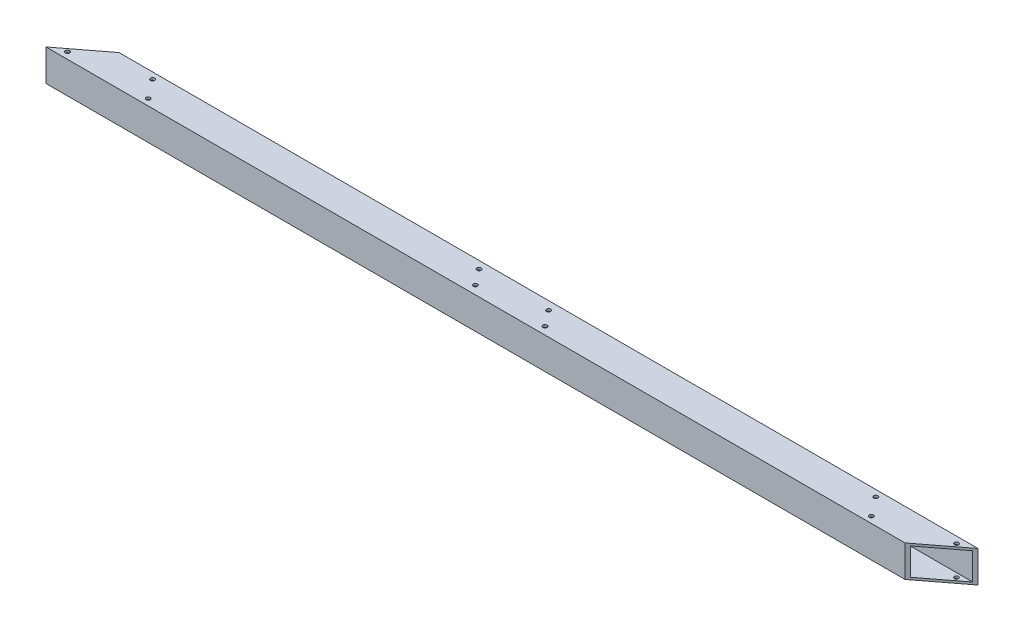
ISO-10303-21;
HEADER;
FILE_DESCRIPTION(('STEP AP214'),'2;1');
FILE_NAME('part.step','',(''),(''),'','','');
FILE_SCHEMA(('AUTOMOTIVE_DESIGN { 1 0 10303 214 1 1 1 1 }'));
ENDSEC;
DATA;
#1=APPLICATION_CONTEXT('core data for automotive mechanical design processes');
#2=APPLICATION_PROTOCOL_DEFINITION('international standard','automotive_design',2000,#1);
#3=PRODUCT_CONTEXT('',#1,'mechanical');
#4=PRODUCT('Part','Part','',(#3));
#5=PRODUCT_RELATED_PRODUCT_CATEGORY('part','',(#4));
#6=PRODUCT_DEFINITION_FORMATION('','',#4);
#7=PRODUCT_DEFINITION_CONTEXT('part definition',#1,'design');
#8=PRODUCT_DEFINITION('design','',#6,#7);
#9=PRODUCT_DEFINITION_SHAPE('','',#8);
#10=(LENGTH_UNIT() NAMED_UNIT(*) SI_UNIT(.MILLI.,.METRE.));
#11=(NAMED_UNIT(*) PLANE_ANGLE_UNIT() SI_UNIT($,.RADIAN.));
#12=(NAMED_UNIT(*) SI_UNIT($,.STERADIAN.) SOLID_ANGLE_UNIT());
#13=UNCERTAINTY_MEASURE_WITH_UNIT(LENGTH_MEASURE(1.E-05),#10,'distance_accuracy_value','');
#14=(GEOMETRIC_REPRESENTATION_CONTEXT(3) GLOBAL_UNCERTAINTY_ASSIGNED_CONTEXT((#13)) GLOBAL_UNIT_ASSIGNED_CONTEXT((#10,
#11,#12)) REPRESENTATION_CONTEXT('',''));
#15=CARTESIAN_POINT('',(0.,0.,0.));
#16=DIRECTION('',(0.,0.,1.));
#17=DIRECTION('',(1.,0.,0.));
#18=AXIS2_PLACEMENT_3D('',#15,#16,#17);
#19=CARTESIAN_POINT('',(3048.,0.,-6.66133814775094E-13));
#20=DIRECTION('',(0.,0.,-1.));
#21=DIRECTION('',(-1.,0.,0.));
#22=AXIS2_PLACEMENT_3D('',#19,#20,#21);
#23=PLANE('',#22);
#24=DIRECTION('',(-1.,0.,0.));
#25=VECTOR('',#24,1.);
#26=CARTESIAN_POINT('',(3048.,0.,-6.66133814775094E-13));
#27=LINE('',#26,#25);
#28=CARTESIAN_POINT('',(1378.39812302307,0.,0.));
#29=VERTEX_POINT('',#28);
#30=CARTESIAN_POINT('',(1.11022302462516E-13,0.,0.));
#31=VERTEX_POINT('',#30);
#32=EDGE_CURVE('E38',#29,#31,#27,.T.);
#33=ORIENTED_EDGE('',*,*,#32,.F.);
#34=DIRECTION('',(0.,1.,0.));
#35=VECTOR('',#34,1.);
#36=CARTESIAN_POINT('',(1378.39812302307,0.,2.22044604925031E-13));
#37=LINE('',#36,#35);
#38=CARTESIAN_POINT('',(1378.39812302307,50.8,0.));
#39=VERTEX_POINT('',#38);
#40=EDGE_CURVE('E251',#29,#39,#37,.T.);
#41=ORIENTED_EDGE('',*,*,#40,.T.);
#42=DIRECTION('',(-1.,0.,0.));
#43=VECTOR('',#42,1.);
#44=CARTESIAN_POINT('',(3048.,50.8,-6.66133814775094E-13));
#45=LINE('',#44,#43);
#46=CARTESIAN_POINT('',(1.11022302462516E-13,50.8,0.));
#47=VERTEX_POINT('',#46);
#48=EDGE_CURVE('E117',#39,#47,#45,.T.);
#49=ORIENTED_EDGE('',*,*,#48,.T.);
#50=DIRECTION('',(0.,-1.,0.));
#51=VECTOR('',#50,1.);
#52=CARTESIAN_POINT('',(1.11022302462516E-13,0.,0.));
#53=LINE('',#52,#51);
#54=EDGE_CURVE('E125',#47,#31,#53,.T.);
#55=ORIENTED_EDGE('',*,*,#54,.T.);
#56=EDGE_LOOP('',(#33,#41,#49,#55));
#57=FACE_BOUND('',#56,.T.);
#58=ADVANCED_FACE('F30',(#57),#23,.F.);
#59=CARTESIAN_POINT('',(3048.,0.,-6.66133814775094E-13));
#60=DIRECTION('',(0.,1.,0.));
#61=DIRECTION('',(0.,0.,1.));
#62=AXIS2_PLACEMENT_3D('',#59,#60,#61);
#63=PLANE('',#62);
#64=CARTESIAN_POINT('',(23.981912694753,0.,-10.4615786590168));
#65=DIRECTION('',(0.,-1.,0.));
#66=DIRECTION('',(0.,0.,-1.));
#67=AXIS2_PLACEMENT_3D('',#64,#65,#66);
#68=CIRCLE('',#67,3.37312000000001);
#69=CARTESIAN_POINT('',(23.981912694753,0.,-13.8346986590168));
#70=VERTEX_POINT('',#69);
#71=EDGE_CURVE('E374',#70,#70,#68,.T.);
#72=ORIENTED_EDGE('',*,*,#71,.F.);
#73=EDGE_LOOP('',(#72));
#74=FACE_BOUND('',#73,.T.);
#75=CARTESIAN_POINT('',(130.507572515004,0.,-40.5671943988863));
#76=DIRECTION('',(0.,-1.,0.));
#77=DIRECTION('',(0.,0.,-1.));
#78=AXIS2_PLACEMENT_3D('',#75,#76,#77);
#79=CIRCLE('',#78,3.37312000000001);
#80=CARTESIAN_POINT('',(130.507572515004,0.,-43.9403143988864));
#81=VERTEX_POINT('',#80);
#82=EDGE_CURVE('E179',#81,#81,#79,.T.);
#83=ORIENTED_EDGE('',*,*,#82,.F.);
#84=EDGE_LOOP('',(#83));
#85=FACE_BOUND('',#84,.T.);
#86=CARTESIAN_POINT('',(153.67607471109,0.,-10.3210292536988));
#87=DIRECTION('',(0.,-1.,0.));
#88=DIRECTION('',(0.,0.,-1.));
#89=AXIS2_PLACEMENT_3D('',#86,#87,#88);
#90=CIRCLE('',#89,3.37312000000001);
#91=CARTESIAN_POINT('',(153.67607471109,0.,-13.6941492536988));
#92=VERTEX_POINT('',#91);
#93=EDGE_CURVE('E176',#92,#92,#90,.T.);
#94=ORIENTED_EDGE('',*,*,#93,.F.);
#95=EDGE_LOOP('',(#94));
#96=FACE_BOUND('',#95,.T.);
#97=CARTESIAN_POINT('',(1420.73492080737,0.,-40.3384213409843));
#98=DIRECTION('',(0.,-1.,0.));
#99=DIRECTION('',(0.,0.,-1.));
#100=AXIS2_PLACEMENT_3D('',#97,#98,#99);
#101=CIRCLE('',#100,3.37311999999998);
#102=CARTESIAN_POINT('',(1420.73492080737,0.,-43.7115413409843));
#103=VERTEX_POINT('',#102);
#104=EDGE_CURVE('E195',#103,#103,#101,.T.);
#105=ORIENTED_EDGE('',*,*,#104,.F.);
#106=EDGE_LOOP('',(#105));
#107=FACE_BOUND('',#106,.T.);
#108=CARTESIAN_POINT('',(1291.04075879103,0.,-40.4789707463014));
#109=DIRECTION('',(0.,-1.,0.));
#110=DIRECTION('',(0.,0.,-1.));
#111=AXIS2_PLACEMENT_3D('',#108,#109,#110);
#112=CIRCLE('',#111,3.37311999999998);
#113=CARTESIAN_POINT('',(1291.04075879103,0.,-43.8520907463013));
#114=VERTEX_POINT('',#113);
#115=EDGE_CURVE('E202',#114,#114,#112,.T.);
#116=ORIENTED_EDGE('',*,*,#115,.F.);
#117=EDGE_LOOP('',(#116));
#118=FACE_BOUND('',#117,.T.);
#119=CARTESIAN_POINT('',(1314.20926098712,0.,-10.2328056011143));
#120=DIRECTION('',(0.,-1.,0.));
#121=DIRECTION('',(0.,0.,-1.));
#122=AXIS2_PLACEMENT_3D('',#119,#120,#121);
#123=CIRCLE('',#122,3.37311999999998);
#124=CARTESIAN_POINT('',(1314.20926098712,0.,-13.6059256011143));
#125=VERTEX_POINT('',#124);
#126=EDGE_CURVE('E209',#125,#125,#123,.T.);
#127=ORIENTED_EDGE('',*,*,#126,.F.);
#128=EDGE_LOOP('',(#127));
#129=FACE_BOUND('',#128,.T.);
#130=CARTESIAN_POINT('',(656.179889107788,0.,-38.6983009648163));
#131=DIRECTION('',(0.,-1.,0.));
#132=DIRECTION('',(0.,0.,-1.));
#133=AXIS2_PLACEMENT_3D('',#130,#131,#132);
#134=CIRCLE('',#133,3.39212682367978);
#135=CARTESIAN_POINT('',(656.179889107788,0.,-42.0904277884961));
#136=VERTEX_POINT('',#135);
#137=EDGE_CURVE('E216',#136,#136,#134,.T.);
#138=ORIENTED_EDGE('',*,*,#137,.F.);
#139=EDGE_LOOP('',(#138));
#140=FACE_BOUND('',#139,.T.);
#141=CARTESIAN_POINT('',(675.486974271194,0.,-13.4931633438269));
#142=DIRECTION('',(0.,-1.,0.));
#143=DIRECTION('',(0.,0.,-1.));
#144=AXIS2_PLACEMENT_3D('',#141,#142,#143);
#145=CIRCLE('',#144,3.39212682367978);
#146=CARTESIAN_POINT('',(675.486974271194,0.,-16.8852901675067));
#147=VERTEX_POINT('',#146);
#148=EDGE_CURVE('E223',#147,#147,#145,.T.);
#149=ORIENTED_EDGE('',*,*,#148,.F.);
#150=EDGE_LOOP('',(#149));
#151=FACE_BOUND('',#150,.T.);
#152=CARTESIAN_POINT('',(769.22986180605,0.,-37.306836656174));
#153=DIRECTION('',(0.,-1.,0.));
#154=DIRECTION('',(0.,0.,-1.));
#155=AXIS2_PLACEMENT_3D('',#152,#153,#154);
#156=CIRCLE('',#155,3.39212682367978);
#157=CARTESIAN_POINT('',(769.22986180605,0.,-40.6989634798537));
#158=VERTEX_POINT('',#157);
#159=EDGE_CURVE('E230',#158,#158,#156,.T.);
#160=ORIENTED_EDGE('',*,*,#159,.F.);
#161=EDGE_LOOP('',(#160));
#162=FACE_BOUND('',#161,.T.);
#163=CARTESIAN_POINT('',(788.536946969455,0.,-12.1016990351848));
#164=DIRECTION('',(0.,-1.,0.));
#165=DIRECTION('',(0.,0.,-1.));
#166=AXIS2_PLACEMENT_3D('',#163,#164,#165);
#167=CIRCLE('',#166,3.39212682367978);
#168=CARTESIAN_POINT('',(788.536946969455,0.,-15.4938258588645));
#169=VERTEX_POINT('',#168);
#170=EDGE_CURVE('E237',#169,#169,#167,.T.);
#171=ORIENTED_EDGE('',*,*,#170,.F.);
#172=EDGE_LOOP('',(#171));
#173=FACE_BOUND('',#172,.T.);
#174=DIRECTION('',(-1.,0.,0.));
#175=VECTOR('',#174,1.);
#176=CARTESIAN_POINT('',(3048.,0.,-50.8000000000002));
#177=LINE('',#176,#175);
#178=CARTESIAN_POINT('',(1444.71683350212,0.,-50.8000000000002));
#179=VERTEX_POINT('',#178);
#180=CARTESIAN_POINT('',(66.3187104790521,0.,-50.8000000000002));
#181=VERTEX_POINT('',#180);
#182=EDGE_CURVE('E122',#179,#181,#177,.T.);
#183=ORIENTED_EDGE('',*,*,#182,.F.);
#184=DIRECTION('',(0.793862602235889,0.,-0.608097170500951));
#185=VECTOR('',#184,1.);
#186=CARTESIAN_POINT('',(1444.71683350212,0.,-50.8000000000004));
#187=LINE('',#186,#185);
#188=EDGE_CURVE('E103',#29,#179,#187,.T.);
#189=ORIENTED_EDGE('',*,*,#188,.F.);
#190=ORIENTED_EDGE('',*,*,#32,.T.);
#191=DIRECTION('',(-0.793862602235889,0.,0.608097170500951));
#192=VECTOR('',#191,1.);
#193=CARTESIAN_POINT('',(1.11022302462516E-13,0.,0.));
#194=LINE('',#193,#192);
#195=EDGE_CURVE('E253',#181,#31,#194,.T.);
#196=ORIENTED_EDGE('',*,*,#195,.F.);
#197=EDGE_LOOP('',(#183,#189,#190,#196));
#198=FACE_BOUND('',#197,.T.);
#199=ADVANCED_FACE('F280',(#74,#85,#96,#107,#118,#129,#140,#151,#162,#173,#198),#63,.F.);
#200=CARTESIAN_POINT('',(3048.,0.,-50.8000000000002));
#201=DIRECTION('',(0.,0.,1.));
#202=DIRECTION('',(1.,0.,0.));
#203=AXIS2_PLACEMENT_3D('',#200,#201,#202);
#204=PLANE('',#203);
#205=ORIENTED_EDGE('',*,*,#182,.T.);
#206=DIRECTION('',(0.,1.,0.));
#207=VECTOR('',#206,1.);
#208=CARTESIAN_POINT('',(66.3187104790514,0.,-50.8000000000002));
#209=LINE('',#208,#207);
#210=CARTESIAN_POINT('',(66.3187104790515,50.8,-50.7999999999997));
#211=VERTEX_POINT('',#210);
#212=EDGE_CURVE('E109',#181,#211,#209,.T.);
#213=ORIENTED_EDGE('',*,*,#212,.T.);
#214=DIRECTION('',(-1.,0.,0.));
#215=VECTOR('',#214,1.);
#216=CARTESIAN_POINT('',(3048.,50.8,-50.8000000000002));
#217=LINE('',#216,#215);
#218=CARTESIAN_POINT('',(1444.71683350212,50.8,-50.8000000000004));
#219=VERTEX_POINT('',#218);
#220=EDGE_CURVE('E116',#219,#211,#217,.T.);
#221=ORIENTED_EDGE('',*,*,#220,.F.);
#222=DIRECTION('',(0.,-1.,0.));
#223=VECTOR('',#222,1.);
#224=CARTESIAN_POINT('',(1444.71683350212,50.8,-50.8000000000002));
#225=LINE('',#224,#223);
#226=EDGE_CURVE('E97',#219,#179,#225,.T.);
#227=ORIENTED_EDGE('',*,*,#226,.T.);
#228=EDGE_LOOP('',(#205,#213,#221,#227));
#229=FACE_BOUND('',#228,.T.);
#230=ADVANCED_FACE('F121',(#229),#204,.F.);
#231=CARTESIAN_POINT('',(3048.,50.8,-6.66133814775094E-13));
#232=DIRECTION('',(0.,-1.,0.));
#233=DIRECTION('',(0.,0.,-1.));
#234=AXIS2_PLACEMENT_3D('',#231,#232,#233);
#235=PLANE('',#234);
#236=CARTESIAN_POINT('',(23.981912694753,50.8,-10.4615786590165));
#237=DIRECTION('',(0.,-1.,0.));
#238=DIRECTION('',(0.,0.,-1.));
#239=AXIS2_PLACEMENT_3D('',#236,#237,#238);
#240=CIRCLE('',#239,3.37312000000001);
#241=CARTESIAN_POINT('',(23.981912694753,50.8,-13.8346986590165));
#242=VERTEX_POINT('',#241);
#243=EDGE_CURVE('E373',#242,#242,#240,.T.);
#244=ORIENTED_EDGE('',*,*,#243,.T.);
#245=EDGE_LOOP('',(#244));
#246=FACE_BOUND('',#245,.T.);
#247=CARTESIAN_POINT('',(130.507572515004,50.8,-40.5671943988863));
#248=DIRECTION('',(0.,-1.,0.));
#249=DIRECTION('',(0.,0.,-1.));
#250=AXIS2_PLACEMENT_3D('',#247,#248,#249);
#251=CIRCLE('',#250,3.37312000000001);
#252=CARTESIAN_POINT('',(130.507572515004,50.8,-43.9403143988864));
#253=VERTEX_POINT('',#252);
#254=EDGE_CURVE('E172',#253,#253,#251,.T.);
#255=ORIENTED_EDGE('',*,*,#254,.T.);
#256=EDGE_LOOP('',(#255));
#257=FACE_BOUND('',#256,.T.);
#258=CARTESIAN_POINT('',(153.67607471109,50.8,-10.3210292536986));
#259=DIRECTION('',(0.,-1.,0.));
#260=DIRECTION('',(0.,0.,-1.));
#261=AXIS2_PLACEMENT_3D('',#258,#259,#260);
#262=CIRCLE('',#261,3.37312000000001);
#263=CARTESIAN_POINT('',(153.67607471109,50.8,-13.6941492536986));
#264=VERTEX_POINT('',#263);
#265=EDGE_CURVE('E168',#264,#264,#262,.T.);
#266=ORIENTED_EDGE('',*,*,#265,.T.);
#267=EDGE_LOOP('',(#266));
#268=FACE_BOUND('',#267,.T.);
#269=CARTESIAN_POINT('',(1420.73492080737,50.8,-40.3384213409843));
#270=DIRECTION('',(0.,-1.,0.));
#271=DIRECTION('',(0.,0.,-1.));
#272=AXIS2_PLACEMENT_3D('',#269,#270,#271);
#273=CIRCLE('',#272,3.37311999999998);
#274=CARTESIAN_POINT('',(1420.73492080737,50.8,-43.7115413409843));
#275=VERTEX_POINT('',#274);
#276=EDGE_CURVE('E164',#275,#275,#273,.T.);
#277=ORIENTED_EDGE('',*,*,#276,.T.);
#278=EDGE_LOOP('',(#277));
#279=FACE_BOUND('',#278,.T.);
#280=CARTESIAN_POINT('',(1291.04075879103,50.8,-40.4789707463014));
#281=DIRECTION('',(0.,-1.,0.));
#282=DIRECTION('',(0.,0.,-1.));
#283=AXIS2_PLACEMENT_3D('',#280,#281,#282);
#284=CIRCLE('',#283,3.37311999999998);
#285=CARTESIAN_POINT('',(1291.04075879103,50.8,-43.8520907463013));
#286=VERTEX_POINT('',#285);
#287=EDGE_CURVE('E159',#286,#286,#284,.T.);
#288=ORIENTED_EDGE('',*,*,#287,.T.);
#289=EDGE_LOOP('',(#288));
#290=FACE_BOUND('',#289,.T.);
#291=CARTESIAN_POINT('',(1314.20926098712,50.8,-10.2328056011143));
#292=DIRECTION('',(0.,-1.,0.));
#293=DIRECTION('',(0.,0.,-1.));
#294=AXIS2_PLACEMENT_3D('',#291,#292,#293);
#295=CIRCLE('',#294,3.37311999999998);
#296=CARTESIAN_POINT('',(1314.20926098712,50.8,-13.6059256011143));
#297=VERTEX_POINT('',#296);
#298=EDGE_CURVE('E154',#297,#297,#295,.T.);
#299=ORIENTED_EDGE('',*,*,#298,.T.);
#300=EDGE_LOOP('',(#299));
#301=FACE_BOUND('',#300,.T.);
#302=CARTESIAN_POINT('',(656.179889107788,50.8,-38.6983009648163));
#303=DIRECTION('',(0.,-1.,0.));
#304=DIRECTION('',(0.,0.,-1.));
#305=AXIS2_PLACEMENT_3D('',#302,#303,#304);
#306=CIRCLE('',#305,3.39212682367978);
#307=CARTESIAN_POINT('',(656.179889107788,50.8,-42.0904277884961));
#308=VERTEX_POINT('',#307);
#309=EDGE_CURVE('E149',#308,#308,#306,.T.);
#310=ORIENTED_EDGE('',*,*,#309,.T.);
#311=EDGE_LOOP('',(#310));
#312=FACE_BOUND('',#311,.T.);
#313=CARTESIAN_POINT('',(675.486974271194,50.8,-13.4931633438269));
#314=DIRECTION('',(0.,-1.,0.));
#315=DIRECTION('',(0.,0.,-1.));
#316=AXIS2_PLACEMENT_3D('',#313,#314,#315);
#317=CIRCLE('',#316,3.39212682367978);
#318=CARTESIAN_POINT('',(675.486974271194,50.8,-16.8852901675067));
#319=VERTEX_POINT('',#318);
#320=EDGE_CURVE('E144',#319,#319,#317,.T.);
#321=ORIENTED_EDGE('',*,*,#320,.T.);
#322=EDGE_LOOP('',(#321));
#323=FACE_BOUND('',#322,.T.);
#324=CARTESIAN_POINT('',(769.22986180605,50.8,-37.306836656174));
#325=DIRECTION('',(0.,-1.,0.));
#326=DIRECTION('',(0.,0.,-1.));
#327=AXIS2_PLACEMENT_3D('',#324,#325,#326);
#328=CIRCLE('',#327,3.39212682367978);
#329=CARTESIAN_POINT('',(769.22986180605,50.8,-40.6989634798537));
#330=VERTEX_POINT('',#329);
#331=EDGE_CURVE('E139',#330,#330,#328,.T.);
#332=ORIENTED_EDGE('',*,*,#331,.T.);
#333=EDGE_LOOP('',(#332));
#334=FACE_BOUND('',#333,.T.);
#335=CARTESIAN_POINT('',(788.536946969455,50.8,-12.1016990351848));
#336=DIRECTION('',(0.,-1.,0.));
#337=DIRECTION('',(0.,0.,-1.));
#338=AXIS2_PLACEMENT_3D('',#335,#336,#337);
#339=CIRCLE('',#338,3.39212682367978);
#340=CARTESIAN_POINT('',(788.536946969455,50.8,-15.4938258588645));
#341=VERTEX_POINT('',#340);
#342=EDGE_CURVE('E134',#341,#341,#339,.T.);
#343=ORIENTED_EDGE('',*,*,#342,.T.);
#344=EDGE_LOOP('',(#343));
#345=FACE_BOUND('',#344,.T.);
#346=ORIENTED_EDGE('',*,*,#48,.F.);
#347=DIRECTION('',(0.793862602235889,0.,-0.608097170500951));
#348=VECTOR('',#347,1.);
#349=CARTESIAN_POINT('',(1444.71683350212,50.8,-50.8000000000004));
#350=LINE('',#349,#348);
#351=EDGE_CURVE('E100',#39,#219,#350,.T.);
#352=ORIENTED_EDGE('',*,*,#351,.T.);
#353=ORIENTED_EDGE('',*,*,#220,.T.);
#354=DIRECTION('',(-0.793862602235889,0.,0.608097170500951));
#355=VECTOR('',#354,1.);
#356=CARTESIAN_POINT('',(1.11022302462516E-13,50.8,0.));
#357=LINE('',#356,#355);
#358=EDGE_CURVE('E254',#211,#47,#357,.T.);
#359=ORIENTED_EDGE('',*,*,#358,.T.);
#360=EDGE_LOOP('',(#346,#352,#353,#359));
#361=FACE_BOUND('',#360,.T.);
#362=ADVANCED_FACE('F114',(#246,#257,#268,#279,#290,#301,#312,#323,#334,#345,#361),#235,.F.);
#363=CARTESIAN_POINT('',(3048.,47.1424,-3.65759999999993));
#364=DIRECTION('',(0.,0.,-1.));
#365=DIRECTION('',(0.,1.,0.));
#366=AXIS2_PLACEMENT_3D('',#363,#364,#365);
#367=PLANE('',#366);
#368=DIRECTION('',(0.,1.,0.));
#369=VECTOR('',#368,1.);
#370=CARTESIAN_POINT('',(1383.17307017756,47.1423999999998,-3.65759999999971));
#371=LINE('',#370,#369);
#372=CARTESIAN_POINT('',(1383.17307017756,3.65760000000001,-3.65760000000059));
#373=VERTEX_POINT('',#372);
#374=CARTESIAN_POINT('',(1383.17307017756,47.1424,-3.65760000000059));
#375=VERTEX_POINT('',#374);
#376=EDGE_CURVE('E46',#373,#375,#371,.T.);
#377=ORIENTED_EDGE('',*,*,#376,.F.);
#378=DIRECTION('',(-1.,0.,0.));
#379=VECTOR('',#378,1.);
#380=CARTESIAN_POINT('',(3048.,3.65760000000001,-3.65759999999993));
#381=LINE('',#380,#379);
#382=CARTESIAN_POINT('',(4.77494715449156,3.65760000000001,-3.65760000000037));
#383=VERTEX_POINT('',#382);
#384=EDGE_CURVE('E271',#373,#383,#381,.T.);
#385=ORIENTED_EDGE('',*,*,#384,.T.);
#386=DIRECTION('',(0.,-1.,0.));
#387=VECTOR('',#386,1.);
#388=CARTESIAN_POINT('',(4.77494715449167,47.1423999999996,-3.65759999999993));
#389=LINE('',#388,#387);
#390=CARTESIAN_POINT('',(4.77494715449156,47.1424,-3.65760000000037));
#391=VERTEX_POINT('',#390);
#392=EDGE_CURVE('E263',#391,#383,#389,.T.);
#393=ORIENTED_EDGE('',*,*,#392,.F.);
#394=DIRECTION('',(-1.,0.,0.));
#395=VECTOR('',#394,1.);
#396=CARTESIAN_POINT('',(3048.,47.1424,-3.65759999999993));
#397=LINE('',#396,#395);
#398=EDGE_CURVE('E108',#375,#391,#397,.T.);
#399=ORIENTED_EDGE('',*,*,#398,.F.);
#400=EDGE_LOOP('',(#377,#385,#393,#399));
#401=FACE_BOUND('',#400,.T.);
#402=ADVANCED_FACE('F293',(#401),#367,.T.);
#403=CARTESIAN_POINT('',(3048.,3.65760000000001,-3.65759999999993));
#404=DIRECTION('',(0.,1.,0.));
#405=DIRECTION('',(0.,0.,1.));
#406=AXIS2_PLACEMENT_3D('',#403,#404,#405);
#407=PLANE('',#406);
#408=CARTESIAN_POINT('',(23.981912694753,3.65760000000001,-10.4615786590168));
#409=DIRECTION('',(0.,1.,0.));
#410=DIRECTION('',(0.,0.,1.));
#411=AXIS2_PLACEMENT_3D('',#408,#409,#410);
#412=CIRCLE('',#411,3.37312000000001);
#413=CARTESIAN_POINT('',(23.981912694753,3.65760000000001,-7.08845865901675));
#414=VERTEX_POINT('',#413);
#415=EDGE_CURVE('E184',#414,#414,#412,.T.);
#416=ORIENTED_EDGE('',*,*,#415,.F.);
#417=EDGE_LOOP('',(#416));
#418=FACE_BOUND('',#417,.T.);
#419=CARTESIAN_POINT('',(130.507572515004,3.65760000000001,-40.5671943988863));
#420=DIRECTION('',(0.,1.,0.));
#421=DIRECTION('',(0.,0.,1.));
#422=AXIS2_PLACEMENT_3D('',#419,#420,#421);
#423=CIRCLE('',#422,3.37312000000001);
#424=CARTESIAN_POINT('',(130.507572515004,3.65760000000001,-37.1940743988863));
#425=VERTEX_POINT('',#424);
#426=EDGE_CURVE('E171',#425,#425,#423,.T.);
#427=ORIENTED_EDGE('',*,*,#426,.F.);
#428=EDGE_LOOP('',(#427));
#429=FACE_BOUND('',#428,.T.);
#430=CARTESIAN_POINT('',(153.67607471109,3.65759999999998,-10.3210292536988));
#431=DIRECTION('',(0.,1.,0.));
#432=DIRECTION('',(0.,0.,1.));
#433=AXIS2_PLACEMENT_3D('',#430,#431,#432);
#434=CIRCLE('',#433,3.37312000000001);
#435=CARTESIAN_POINT('',(153.67607471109,3.65759999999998,-6.94790925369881));
#436=VERTEX_POINT('',#435);
#437=EDGE_CURVE('E167',#436,#436,#434,.T.);
#438=ORIENTED_EDGE('',*,*,#437,.F.);
#439=EDGE_LOOP('',(#438));
#440=FACE_BOUND('',#439,.T.);
#441=CARTESIAN_POINT('',(1420.73492080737,3.65760000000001,-40.3384213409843));
#442=DIRECTION('',(0.,1.,0.));
#443=DIRECTION('',(0.,0.,1.));
#444=AXIS2_PLACEMENT_3D('',#441,#442,#443);
#445=CIRCLE('',#444,3.37311999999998);
#446=CARTESIAN_POINT('',(1420.73492080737,3.65760000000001,-36.9653013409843));
#447=VERTEX_POINT('',#446);
#448=EDGE_CURVE('E163',#447,#447,#445,.T.);
#449=ORIENTED_EDGE('',*,*,#448,.F.);
#450=EDGE_LOOP('',(#449));
#451=FACE_BOUND('',#450,.T.);
#452=CARTESIAN_POINT('',(1291.04075879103,3.65760000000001,-40.4789707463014));
#453=DIRECTION('',(0.,1.,0.));
#454=DIRECTION('',(0.,0.,1.));
#455=AXIS2_PLACEMENT_3D('',#452,#453,#454);
#456=CIRCLE('',#455,3.37311999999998);
#457=CARTESIAN_POINT('',(1291.04075879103,3.65760000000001,-37.1058507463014));
#458=VERTEX_POINT('',#457);
#459=EDGE_CURVE('E158',#458,#458,#456,.T.);
#460=ORIENTED_EDGE('',*,*,#459,.F.);
#461=EDGE_LOOP('',(#460));
#462=FACE_BOUND('',#461,.T.);
#463=CARTESIAN_POINT('',(1314.20926098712,3.65760000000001,-10.2328056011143));
#464=DIRECTION('',(0.,1.,0.));
#465=DIRECTION('',(0.,0.,1.));
#466=AXIS2_PLACEMENT_3D('',#463,#464,#465);
#467=CIRCLE('',#466,3.37311999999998);
#468=CARTESIAN_POINT('',(1314.20926098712,3.65760000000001,-6.8596856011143));
#469=VERTEX_POINT('',#468);
#470=EDGE_CURVE('E153',#469,#469,#467,.T.);
#471=ORIENTED_EDGE('',*,*,#470,.F.);
#472=EDGE_LOOP('',(#471));
#473=FACE_BOUND('',#472,.T.);
#474=CARTESIAN_POINT('',(656.179889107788,3.65759999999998,-38.6983009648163));
#475=DIRECTION('',(0.,1.,0.));
#476=DIRECTION('',(0.,0.,1.));
#477=AXIS2_PLACEMENT_3D('',#474,#475,#476);
#478=CIRCLE('',#477,3.39212682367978);
#479=CARTESIAN_POINT('',(656.179889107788,3.65759999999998,-35.3061741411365));
#480=VERTEX_POINT('',#479);
#481=EDGE_CURVE('E148',#480,#480,#478,.T.);
#482=ORIENTED_EDGE('',*,*,#481,.F.);
#483=EDGE_LOOP('',(#482));
#484=FACE_BOUND('',#483,.T.);
#485=CARTESIAN_POINT('',(675.486974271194,3.65760000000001,-13.4931633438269));
#486=DIRECTION('',(0.,1.,0.));
#487=DIRECTION('',(0.,0.,1.));
#488=AXIS2_PLACEMENT_3D('',#485,#486,#487);
#489=CIRCLE('',#488,3.39212682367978);
#490=CARTESIAN_POINT('',(675.486974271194,3.65760000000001,-10.1010365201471));
#491=VERTEX_POINT('',#490);
#492=EDGE_CURVE('E143',#491,#491,#489,.T.);
#493=ORIENTED_EDGE('',*,*,#492,.F.);
#494=EDGE_LOOP('',(#493));
#495=FACE_BOUND('',#494,.T.);
#496=CARTESIAN_POINT('',(769.22986180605,3.65760000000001,-37.306836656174));
#497=DIRECTION('',(0.,1.,0.));
#498=DIRECTION('',(0.,0.,1.));
#499=AXIS2_PLACEMENT_3D('',#496,#497,#498);
#500=CIRCLE('',#499,3.39212682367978);
#501=CARTESIAN_POINT('',(769.22986180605,3.65760000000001,-33.9147098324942));
#502=VERTEX_POINT('',#501);
#503=EDGE_CURVE('E138',#502,#502,#500,.T.);
#504=ORIENTED_EDGE('',*,*,#503,.F.);
#505=EDGE_LOOP('',(#504));
#506=FACE_BOUND('',#505,.T.);
#507=CARTESIAN_POINT('',(788.536946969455,3.65760000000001,-12.1016990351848));
#508=DIRECTION('',(0.,1.,0.));
#509=DIRECTION('',(0.,0.,1.));
#510=AXIS2_PLACEMENT_3D('',#507,#508,#509);
#511=CIRCLE('',#510,3.39212682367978);
#512=CARTESIAN_POINT('',(788.536946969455,3.65760000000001,-8.70957221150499));
#513=VERTEX_POINT('',#512);
#514=EDGE_CURVE('E133',#513,#513,#511,.T.);
#515=ORIENTED_EDGE('',*,*,#514,.F.);
#516=EDGE_LOOP('',(#515));
#517=FACE_BOUND('',#516,.T.);
#518=DIRECTION('',(-0.793862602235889,0.,0.608097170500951));
#519=VECTOR('',#518,1.);
#520=CARTESIAN_POINT('',(2432.37668726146,3.65760000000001,-807.345478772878));
#521=LINE('',#520,#519);
#522=CARTESIAN_POINT('',(1439.94188634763,3.65760000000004,-47.1423999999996));
#523=VERTEX_POINT('',#522);
#524=EDGE_CURVE('E248',#523,#373,#521,.T.);
#525=ORIENTED_EDGE('',*,*,#524,.F.);
#526=DIRECTION('',(-1.,0.,0.));
#527=VECTOR('',#526,1.);
#528=CARTESIAN_POINT('',(3048.,3.65760000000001,-47.1424000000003));
#529=LINE('',#528,#527);
#530=CARTESIAN_POINT('',(61.5437633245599,3.65760000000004,-47.1423999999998));
#531=VERTEX_POINT('',#530);
#532=EDGE_CURVE('E269',#523,#531,#529,.T.);
#533=ORIENTED_EDGE('',*,*,#532,.T.);
#534=DIRECTION('',(0.79386260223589,0.,-0.608097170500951));
#535=VECTOR('',#534,1.);
#536=CARTESIAN_POINT('',(1922.66963989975,3.65760000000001,-1472.76111072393));
#537=LINE('',#536,#535);
#538=EDGE_CURVE('E260',#383,#531,#537,.T.);
#539=ORIENTED_EDGE('',*,*,#538,.F.);
#540=ORIENTED_EDGE('',*,*,#384,.F.);
#541=EDGE_LOOP('',(#525,#533,#539,#540));
#542=FACE_BOUND('',#541,.T.);
#543=ADVANCED_FACE('F297',(#418,#429,#440,#451,#462,#473,#484,#495,#506,#517,#542),#407,.T.);
#544=CARTESIAN_POINT('',(3048.,47.1424,-47.1424000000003));
#545=DIRECTION('',(0.,0.,1.));
#546=DIRECTION('',(0.,-1.,0.));
#547=AXIS2_PLACEMENT_3D('',#544,#545,#546);
#548=PLANE('',#547);
#549=DIRECTION('',(0.,-1.,0.));
#550=VECTOR('',#549,1.);
#551=CARTESIAN_POINT('',(1439.94188634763,47.1423999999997,-47.1423999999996));
#552=LINE('',#551,#550);
#553=CARTESIAN_POINT('',(1439.94188634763,47.1424,-47.1423999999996));
#554=VERTEX_POINT('',#553);
#555=EDGE_CURVE('E246',#554,#523,#552,.T.);
#556=ORIENTED_EDGE('',*,*,#555,.F.);
#557=DIRECTION('',(-1.,0.,0.));
#558=VECTOR('',#557,1.);
#559=CARTESIAN_POINT('',(3048.,47.1424,-47.1424000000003));
#560=LINE('',#559,#558);
#561=CARTESIAN_POINT('',(61.5437633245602,47.1424,-47.1424));
#562=VERTEX_POINT('',#561);
#563=EDGE_CURVE('E54',#554,#562,#560,.T.);
#564=ORIENTED_EDGE('',*,*,#563,.T.);
#565=DIRECTION('',(0.,1.,0.));
#566=VECTOR('',#565,1.);
#567=CARTESIAN_POINT('',(61.5437633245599,47.1423999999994,-47.1423999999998));
#568=LINE('',#567,#566);
#569=EDGE_CURVE('E256',#531,#562,#568,.T.);
#570=ORIENTED_EDGE('',*,*,#569,.F.);
#571=ORIENTED_EDGE('',*,*,#532,.F.);
#572=EDGE_LOOP('',(#556,#564,#570,#571));
#573=FACE_BOUND('',#572,.T.);
#574=ADVANCED_FACE('F301',(#573),#548,.T.);
#575=CARTESIAN_POINT('',(3048.,47.1424,-3.65759999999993));
#576=DIRECTION('',(0.,-1.,0.));
#577=DIRECTION('',(0.,0.,-1.));
#578=AXIS2_PLACEMENT_3D('',#575,#576,#577);
#579=PLANE('',#578);
#580=CARTESIAN_POINT('',(23.981912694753,47.1424,-10.4615786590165));
#581=DIRECTION('',(0.,-1.,0.));
#582=DIRECTION('',(0.,0.,-1.));
#583=AXIS2_PLACEMENT_3D('',#580,#581,#582);
#584=CIRCLE('',#583,3.37312000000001);
#585=CARTESIAN_POINT('',(23.981912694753,47.1424,-13.8346986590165));
#586=VERTEX_POINT('',#585);
#587=EDGE_CURVE('E33',#586,#586,#584,.T.);
#588=ORIENTED_EDGE('',*,*,#587,.F.);
#589=EDGE_LOOP('',(#588));
#590=FACE_BOUND('',#589,.T.);
#591=CARTESIAN_POINT('',(130.507572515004,47.1424,-40.5671943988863));
#592=DIRECTION('',(0.,-1.,0.));
#593=DIRECTION('',(0.,0.,-1.));
#594=AXIS2_PLACEMENT_3D('',#591,#592,#593);
#595=CIRCLE('',#594,3.37312000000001);
#596=CARTESIAN_POINT('',(130.507572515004,47.1424,-43.9403143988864));
#597=VERTEX_POINT('',#596);
#598=EDGE_CURVE('E169',#597,#597,#595,.T.);
#599=ORIENTED_EDGE('',*,*,#598,.F.);
#600=EDGE_LOOP('',(#599));
#601=FACE_BOUND('',#600,.T.);
#602=CARTESIAN_POINT('',(153.67607471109,47.1424,-10.3210292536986));
#603=DIRECTION('',(0.,-1.,0.));
#604=DIRECTION('',(0.,0.,-1.));
#605=AXIS2_PLACEMENT_3D('',#602,#603,#604);
#606=CIRCLE('',#605,3.37312000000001);
#607=CARTESIAN_POINT('',(153.67607471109,47.1424,-13.6941492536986));
#608=VERTEX_POINT('',#607);
#609=EDGE_CURVE('E165',#608,#608,#606,.T.);
#610=ORIENTED_EDGE('',*,*,#609,.F.);
#611=EDGE_LOOP('',(#610));
#612=FACE_BOUND('',#611,.T.);
#613=CARTESIAN_POINT('',(1420.73492080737,47.1424,-40.3384213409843));
#614=DIRECTION('',(0.,-1.,0.));
#615=DIRECTION('',(0.,0.,-1.));
#616=AXIS2_PLACEMENT_3D('',#613,#614,#615);
#617=CIRCLE('',#616,3.37311999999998);
#618=CARTESIAN_POINT('',(1420.73492080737,47.1424,-43.7115413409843));
#619=VERTEX_POINT('',#618);
#620=EDGE_CURVE('E160',#619,#619,#617,.T.);
#621=ORIENTED_EDGE('',*,*,#620,.F.);
#622=EDGE_LOOP('',(#621));
#623=FACE_BOUND('',#622,.T.);
#624=CARTESIAN_POINT('',(1291.04075879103,47.1424,-40.4789707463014));
#625=DIRECTION('',(0.,-1.,0.));
#626=DIRECTION('',(0.,0.,-1.));
#627=AXIS2_PLACEMENT_3D('',#624,#625,#626);
#628=CIRCLE('',#627,3.37311999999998);
#629=CARTESIAN_POINT('',(1291.04075879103,47.1424,-43.8520907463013));
#630=VERTEX_POINT('',#629);
#631=EDGE_CURVE('E155',#630,#630,#628,.T.);
#632=ORIENTED_EDGE('',*,*,#631,.F.);
#633=EDGE_LOOP('',(#632));
#634=FACE_BOUND('',#633,.T.);
#635=CARTESIAN_POINT('',(1314.20926098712,47.1424,-10.2328056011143));
#636=DIRECTION('',(0.,-1.,0.));
#637=DIRECTION('',(0.,0.,-1.));
#638=AXIS2_PLACEMENT_3D('',#635,#636,#637);
#639=CIRCLE('',#638,3.37311999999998);
#640=CARTESIAN_POINT('',(1314.20926098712,47.1424,-13.6059256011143));
#641=VERTEX_POINT('',#640);
#642=EDGE_CURVE('E150',#641,#641,#639,.T.);
#643=ORIENTED_EDGE('',*,*,#642,.F.);
#644=EDGE_LOOP('',(#643));
#645=FACE_BOUND('',#644,.T.);
#646=CARTESIAN_POINT('',(656.179889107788,47.1424,-38.6983009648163));
#647=DIRECTION('',(0.,-1.,0.));
#648=DIRECTION('',(0.,0.,-1.));
#649=AXIS2_PLACEMENT_3D('',#646,#647,#648);
#650=CIRCLE('',#649,3.39212682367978);
#651=CARTESIAN_POINT('',(656.179889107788,47.1424,-42.0904277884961));
#652=VERTEX_POINT('',#651);
#653=EDGE_CURVE('E145',#652,#652,#650,.T.);
#654=ORIENTED_EDGE('',*,*,#653,.F.);
#655=EDGE_LOOP('',(#654));
#656=FACE_BOUND('',#655,.T.);
#657=CARTESIAN_POINT('',(675.486974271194,47.1424,-13.4931633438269));
#658=DIRECTION('',(0.,-1.,0.));
#659=DIRECTION('',(0.,0.,-1.));
#660=AXIS2_PLACEMENT_3D('',#657,#658,#659);
#661=CIRCLE('',#660,3.39212682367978);
#662=CARTESIAN_POINT('',(675.486974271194,47.1424,-16.8852901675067));
#663=VERTEX_POINT('',#662);
#664=EDGE_CURVE('E140',#663,#663,#661,.T.);
#665=ORIENTED_EDGE('',*,*,#664,.F.);
#666=EDGE_LOOP('',(#665));
#667=FACE_BOUND('',#666,.T.);
#668=CARTESIAN_POINT('',(769.22986180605,47.1424,-37.306836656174));
#669=DIRECTION('',(0.,-1.,0.));
#670=DIRECTION('',(0.,0.,-1.));
#671=AXIS2_PLACEMENT_3D('',#668,#669,#670);
#672=CIRCLE('',#671,3.39212682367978);
#673=CARTESIAN_POINT('',(769.22986180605,47.1424,-40.6989634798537));
#674=VERTEX_POINT('',#673);
#675=EDGE_CURVE('E135',#674,#674,#672,.T.);
#676=ORIENTED_EDGE('',*,*,#675,.F.);
#677=EDGE_LOOP('',(#676));
#678=FACE_BOUND('',#677,.T.);
#679=CARTESIAN_POINT('',(788.536946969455,47.1424,-12.1016990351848));
#680=DIRECTION('',(0.,-1.,0.));
#681=DIRECTION('',(0.,0.,-1.));
#682=AXIS2_PLACEMENT_3D('',#679,#680,#681);
#683=CIRCLE('',#682,3.39212682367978);
#684=CARTESIAN_POINT('',(788.536946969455,47.1424,-15.4938258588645));
#685=VERTEX_POINT('',#684);
#686=EDGE_CURVE('E130',#685,#685,#683,.T.);
#687=ORIENTED_EDGE('',*,*,#686,.F.);
#688=EDGE_LOOP('',(#687));
#689=FACE_BOUND('',#688,.T.);
#690=DIRECTION('',(0.793862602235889,0.,-0.608097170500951));
#691=VECTOR('',#690,1.);
#692=CARTESIAN_POINT('',(2432.37668726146,47.1424,-807.345478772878));
#693=LINE('',#692,#691);
#694=EDGE_CURVE('E118',#375,#554,#693,.T.);
#695=ORIENTED_EDGE('',*,*,#694,.F.);
#696=ORIENTED_EDGE('',*,*,#398,.T.);
#697=DIRECTION('',(-0.79386260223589,0.,0.608097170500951));
#698=VECTOR('',#697,1.);
#699=CARTESIAN_POINT('',(1922.66963989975,47.1424,-1472.76111072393));
#700=LINE('',#699,#698);
#701=EDGE_CURVE('E11',#562,#391,#700,.T.);
#702=ORIENTED_EDGE('',*,*,#701,.F.);
#703=ORIENTED_EDGE('',*,*,#563,.F.);
#704=EDGE_LOOP('',(#695,#696,#702,#703));
#705=FACE_BOUND('',#704,.T.);
#706=ADVANCED_FACE('F305',(#590,#601,#612,#623,#634,#645,#656,#667,#678,#689,#705),#579,.T.);
#707=CARTESIAN_POINT('',(1.11022302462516E-13,50.8,0.));
#708=DIRECTION('',(0.608097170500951,0.,0.793862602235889));
#709=DIRECTION('',(0.79386260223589,0.,-0.608097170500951));
#710=AXIS2_PLACEMENT_3D('',#707,#708,#709);
#711=PLANE('',#710);
#712=ORIENTED_EDGE('',*,*,#392,.T.);
#713=ORIENTED_EDGE('',*,*,#538,.T.);
#714=ORIENTED_EDGE('',*,*,#569,.T.);
#715=ORIENTED_EDGE('',*,*,#701,.T.);
#716=EDGE_LOOP('',(#712,#713,#714,#715));
#717=FACE_BOUND('',#716,.T.);
#718=ORIENTED_EDGE('',*,*,#195,.T.);
#719=ORIENTED_EDGE('',*,*,#54,.F.);
#720=ORIENTED_EDGE('',*,*,#358,.F.);
#721=ORIENTED_EDGE('',*,*,#212,.F.);
#722=EDGE_LOOP('',(#718,#719,#720,#721));
#723=FACE_BOUND('',#722,.T.);
#724=ADVANCED_FACE('F277',(#717,#723),#711,.F.);
#725=CARTESIAN_POINT('',(1444.71683350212,50.8,-50.8000000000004));
#726=DIRECTION('',(-0.608097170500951,0.,-0.793862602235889));
#727=DIRECTION('',(-0.793862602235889,0.,0.608097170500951));
#728=AXIS2_PLACEMENT_3D('',#725,#726,#727);
#729=PLANE('',#728);
#730=ORIENTED_EDGE('',*,*,#376,.T.);
#731=ORIENTED_EDGE('',*,*,#694,.T.);
#732=ORIENTED_EDGE('',*,*,#555,.T.);
#733=ORIENTED_EDGE('',*,*,#524,.T.);
#734=EDGE_LOOP('',(#730,#731,#732,#733));
#735=FACE_BOUND('',#734,.T.);
#736=ORIENTED_EDGE('',*,*,#188,.T.);
#737=ORIENTED_EDGE('',*,*,#226,.F.);
#738=ORIENTED_EDGE('',*,*,#351,.F.);
#739=ORIENTED_EDGE('',*,*,#40,.F.);
#740=EDGE_LOOP('',(#736,#737,#738,#739));
#741=FACE_BOUND('',#740,.T.);
#742=ADVANCED_FACE('F99',(#735,#741),#729,.F.);
#743=CARTESIAN_POINT('',(788.536946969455,50.8,-12.1016990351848));
#744=DIRECTION('',(0.,-1.,0.));
#745=DIRECTION('',(0.,0.,-1.));
#746=AXIS2_PLACEMENT_3D('',#743,#744,#745);
#747=CYLINDRICAL_SURFACE('',#746,3.39212682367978);
#748=ORIENTED_EDGE('',*,*,#686,.T.);
#749=EDGE_LOOP('',(#748));
#750=FACE_BOUND('',#749,.T.);
#751=ORIENTED_EDGE('',*,*,#342,.F.);
#752=EDGE_LOOP('',(#751));
#753=FACE_BOUND('',#752,.T.);
#754=ADVANCED_FACE('F314',(#750,#753),#747,.F.);
#755=ORIENTED_EDGE('',*,*,#514,.T.);
#756=EDGE_LOOP('',(#755));
#757=FACE_BOUND('',#756,.T.);
#758=ORIENTED_EDGE('',*,*,#170,.T.);
#759=EDGE_LOOP('',(#758));
#760=FACE_BOUND('',#759,.T.);
#761=ADVANCED_FACE('F317',(#757,#760),#747,.F.);
#762=CARTESIAN_POINT('',(769.22986180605,50.8,-37.306836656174));
#763=DIRECTION('',(0.,-1.,0.));
#764=DIRECTION('',(0.,0.,-1.));
#765=AXIS2_PLACEMENT_3D('',#762,#763,#764);
#766=CYLINDRICAL_SURFACE('',#765,3.39212682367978);
#767=ORIENTED_EDGE('',*,*,#675,.T.);
#768=EDGE_LOOP('',(#767));
#769=FACE_BOUND('',#768,.T.);
#770=ORIENTED_EDGE('',*,*,#331,.F.);
#771=EDGE_LOOP('',(#770));
#772=FACE_BOUND('',#771,.T.);
#773=ADVANCED_FACE('F319',(#769,#772),#766,.F.);
#774=ORIENTED_EDGE('',*,*,#503,.T.);
#775=EDGE_LOOP('',(#774));
#776=FACE_BOUND('',#775,.T.);
#777=ORIENTED_EDGE('',*,*,#159,.T.);
#778=EDGE_LOOP('',(#777));
#779=FACE_BOUND('',#778,.T.);
#780=ADVANCED_FACE('F322',(#776,#779),#766,.F.);
#781=CARTESIAN_POINT('',(675.486974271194,50.8,-13.4931633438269));
#782=DIRECTION('',(0.,-1.,0.));
#783=DIRECTION('',(0.,0.,-1.));
#784=AXIS2_PLACEMENT_3D('',#781,#782,#783);
#785=CYLINDRICAL_SURFACE('',#784,3.39212682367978);
#786=ORIENTED_EDGE('',*,*,#664,.T.);
#787=EDGE_LOOP('',(#786));
#788=FACE_BOUND('',#787,.T.);
#789=ORIENTED_EDGE('',*,*,#320,.F.);
#790=EDGE_LOOP('',(#789));
#791=FACE_BOUND('',#790,.T.);
#792=ADVANCED_FACE('F324',(#788,#791),#785,.F.);
#793=ORIENTED_EDGE('',*,*,#492,.T.);
#794=EDGE_LOOP('',(#793));
#795=FACE_BOUND('',#794,.T.);
#796=ORIENTED_EDGE('',*,*,#148,.T.);
#797=EDGE_LOOP('',(#796));
#798=FACE_BOUND('',#797,.T.);
#799=ADVANCED_FACE('F327',(#795,#798),#785,.F.);
#800=CARTESIAN_POINT('',(656.179889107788,50.8,-38.6983009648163));
#801=DIRECTION('',(0.,-1.,0.));
#802=DIRECTION('',(0.,0.,-1.));
#803=AXIS2_PLACEMENT_3D('',#800,#801,#802);
#804=CYLINDRICAL_SURFACE('',#803,3.39212682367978);
#805=ORIENTED_EDGE('',*,*,#653,.T.);
#806=EDGE_LOOP('',(#805));
#807=FACE_BOUND('',#806,.T.);
#808=ORIENTED_EDGE('',*,*,#309,.F.);
#809=EDGE_LOOP('',(#808));
#810=FACE_BOUND('',#809,.T.);
#811=ADVANCED_FACE('F329',(#807,#810),#804,.F.);
#812=ORIENTED_EDGE('',*,*,#481,.T.);
#813=EDGE_LOOP('',(#812));
#814=FACE_BOUND('',#813,.T.);
#815=ORIENTED_EDGE('',*,*,#137,.T.);
#816=EDGE_LOOP('',(#815));
#817=FACE_BOUND('',#816,.T.);
#818=ADVANCED_FACE('F332',(#814,#817),#804,.F.);
#819=CARTESIAN_POINT('',(1314.20926098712,50.8,-10.2328056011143));
#820=DIRECTION('',(0.,-1.,0.));
#821=DIRECTION('',(0.,0.,-1.));
#822=AXIS2_PLACEMENT_3D('',#819,#820,#821);
#823=CYLINDRICAL_SURFACE('',#822,3.37311999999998);
#824=ORIENTED_EDGE('',*,*,#642,.T.);
#825=EDGE_LOOP('',(#824));
#826=FACE_BOUND('',#825,.T.);
#827=ORIENTED_EDGE('',*,*,#298,.F.);
#828=EDGE_LOOP('',(#827));
#829=FACE_BOUND('',#828,.T.);
#830=ADVANCED_FACE('F334',(#826,#829),#823,.F.);
#831=ORIENTED_EDGE('',*,*,#470,.T.);
#832=EDGE_LOOP('',(#831));
#833=FACE_BOUND('',#832,.T.);
#834=ORIENTED_EDGE('',*,*,#126,.T.);
#835=EDGE_LOOP('',(#834));
#836=FACE_BOUND('',#835,.T.);
#837=ADVANCED_FACE('F337',(#833,#836),#823,.F.);
#838=CARTESIAN_POINT('',(1291.04075879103,50.8,-40.4789707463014));
#839=DIRECTION('',(0.,-1.,0.));
#840=DIRECTION('',(0.,0.,-1.));
#841=AXIS2_PLACEMENT_3D('',#838,#839,#840);
#842=CYLINDRICAL_SURFACE('',#841,3.37311999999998);
#843=ORIENTED_EDGE('',*,*,#631,.T.);
#844=EDGE_LOOP('',(#843));
#845=FACE_BOUND('',#844,.T.);
#846=ORIENTED_EDGE('',*,*,#287,.F.);
#847=EDGE_LOOP('',(#846));
#848=FACE_BOUND('',#847,.T.);
#849=ADVANCED_FACE('F339',(#845,#848),#842,.F.);
#850=ORIENTED_EDGE('',*,*,#459,.T.);
#851=EDGE_LOOP('',(#850));
#852=FACE_BOUND('',#851,.T.);
#853=ORIENTED_EDGE('',*,*,#115,.T.);
#854=EDGE_LOOP('',(#853));
#855=FACE_BOUND('',#854,.T.);
#856=ADVANCED_FACE('F342',(#852,#855),#842,.F.);
#857=CARTESIAN_POINT('',(1420.73492080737,50.8,-40.3384213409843));
#858=DIRECTION('',(0.,-1.,0.));
#859=DIRECTION('',(0.,0.,-1.));
#860=AXIS2_PLACEMENT_3D('',#857,#858,#859);
#861=CYLINDRICAL_SURFACE('',#860,3.37311999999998);
#862=ORIENTED_EDGE('',*,*,#620,.T.);
#863=EDGE_LOOP('',(#862));
#864=FACE_BOUND('',#863,.T.);
#865=ORIENTED_EDGE('',*,*,#276,.F.);
#866=EDGE_LOOP('',(#865));
#867=FACE_BOUND('',#866,.T.);
#868=ADVANCED_FACE('F344',(#864,#867),#861,.F.);
#869=ORIENTED_EDGE('',*,*,#448,.T.);
#870=EDGE_LOOP('',(#869));
#871=FACE_BOUND('',#870,.T.);
#872=ORIENTED_EDGE('',*,*,#104,.T.);
#873=EDGE_LOOP('',(#872));
#874=FACE_BOUND('',#873,.T.);
#875=ADVANCED_FACE('F347',(#871,#874),#861,.F.);
#876=CARTESIAN_POINT('',(153.67607471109,50.8,-10.3210292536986));
#877=DIRECTION('',(0.,-1.,0.));
#878=DIRECTION('',(0.,0.,-1.));
#879=AXIS2_PLACEMENT_3D('',#876,#877,#878);
#880=CYLINDRICAL_SURFACE('',#879,3.37312000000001);
#881=ORIENTED_EDGE('',*,*,#609,.T.);
#882=EDGE_LOOP('',(#881));
#883=FACE_BOUND('',#882,.T.);
#884=ORIENTED_EDGE('',*,*,#265,.F.);
#885=EDGE_LOOP('',(#884));
#886=FACE_BOUND('',#885,.T.);
#887=ADVANCED_FACE('F349',(#883,#886),#880,.F.);
#888=ORIENTED_EDGE('',*,*,#437,.T.);
#889=EDGE_LOOP('',(#888));
#890=FACE_BOUND('',#889,.T.);
#891=ORIENTED_EDGE('',*,*,#93,.T.);
#892=EDGE_LOOP('',(#891));
#893=FACE_BOUND('',#892,.T.);
#894=ADVANCED_FACE('F352',(#890,#893),#880,.F.);
#895=CARTESIAN_POINT('',(130.507572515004,50.8,-40.5671943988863));
#896=DIRECTION('',(0.,-1.,0.));
#897=DIRECTION('',(0.,0.,-1.));
#898=AXIS2_PLACEMENT_3D('',#895,#896,#897);
#899=CYLINDRICAL_SURFACE('',#898,3.37312000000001);
#900=ORIENTED_EDGE('',*,*,#598,.T.);
#901=EDGE_LOOP('',(#900));
#902=FACE_BOUND('',#901,.T.);
#903=ORIENTED_EDGE('',*,*,#254,.F.);
#904=EDGE_LOOP('',(#903));
#905=FACE_BOUND('',#904,.T.);
#906=ADVANCED_FACE('F354',(#902,#905),#899,.F.);
#907=ORIENTED_EDGE('',*,*,#426,.T.);
#908=EDGE_LOOP('',(#907));
#909=FACE_BOUND('',#908,.T.);
#910=ORIENTED_EDGE('',*,*,#82,.T.);
#911=EDGE_LOOP('',(#910));
#912=FACE_BOUND('',#911,.T.);
#913=ADVANCED_FACE('F357',(#909,#912),#899,.F.);
#914=CARTESIAN_POINT('',(23.981912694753,50.8,-10.4615786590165));
#915=DIRECTION('',(0.,-1.,0.));
#916=DIRECTION('',(0.,0.,-1.));
#917=AXIS2_PLACEMENT_3D('',#914,#915,#916);
#918=CYLINDRICAL_SURFACE('',#917,3.37312000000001);
#919=ORIENTED_EDGE('',*,*,#587,.T.);
#920=EDGE_LOOP('',(#919));
#921=FACE_BOUND('',#920,.T.);
#922=ORIENTED_EDGE('',*,*,#243,.F.);
#923=EDGE_LOOP('',(#922));
#924=FACE_BOUND('',#923,.T.);
#925=ADVANCED_FACE('F358',(#921,#924),#918,.F.);
#926=ORIENTED_EDGE('',*,*,#415,.T.);
#927=EDGE_LOOP('',(#926));
#928=FACE_BOUND('',#927,.T.);
#929=ORIENTED_EDGE('',*,*,#71,.T.);
#930=EDGE_LOOP('',(#929));
#931=FACE_BOUND('',#930,.T.);
#932=ADVANCED_FACE('F360',(#928,#931),#918,.F.);
#933=CLOSED_SHELL('',(#58,#199,#230,#362,#402,#543,#574,#706,#724,#742,#754,#761,#773,#780,#792,
#799,#811,#818,#830,#837,#849,#856,#868,#875,#887,#894,#906,#913,#925,#932));
#934=MANIFOLD_SOLID_BREP('B2',#933);
#935=ADVANCED_BREP_SHAPE_REPRESENTATION('',(#18,#934),#14);
#936=SHAPE_DEFINITION_REPRESENTATION(#9,#935);
ENDSEC;
END-ISO-10303-21;
